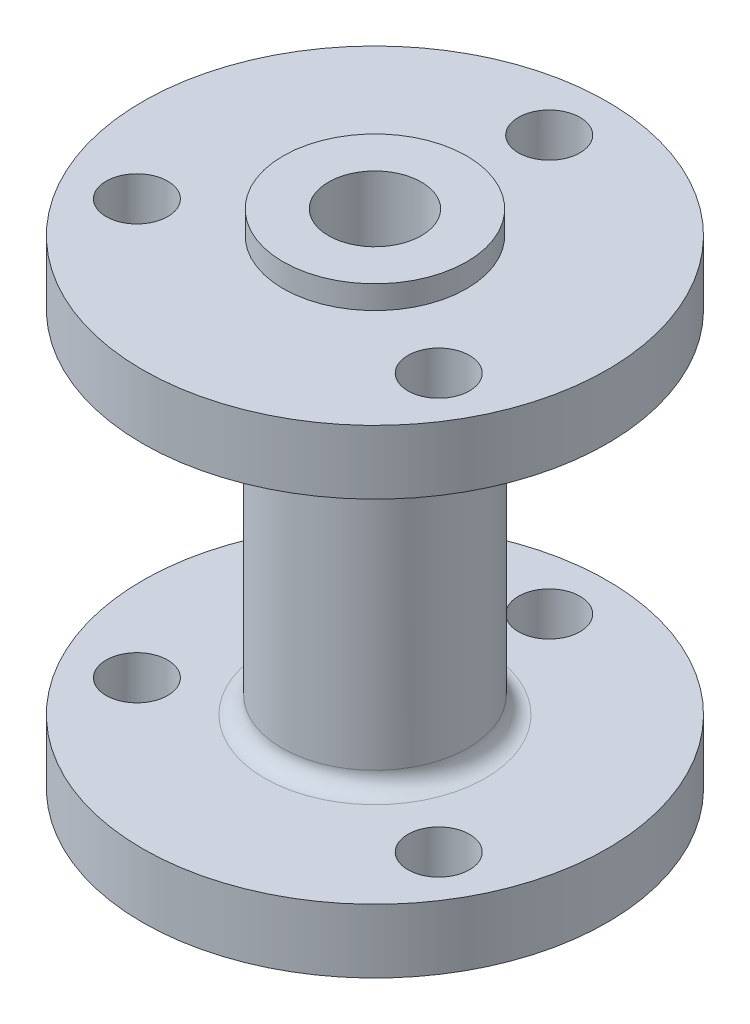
ISO-10303-21;
HEADER;
FILE_DESCRIPTION(('STEP AP214'),'2;1');
FILE_NAME('part.step','',(''),(''),'','','');
FILE_SCHEMA(('AUTOMOTIVE_DESIGN { 1 0 10303 214 1 1 1 1 }'));
ENDSEC;
DATA;
#1=APPLICATION_CONTEXT('core data for automotive mechanical design processes');
#2=APPLICATION_PROTOCOL_DEFINITION('international standard','automotive_design',2000,#1);
#3=PRODUCT_CONTEXT('',#1,'mechanical');
#4=PRODUCT('Part','Part','',(#3));
#5=PRODUCT_RELATED_PRODUCT_CATEGORY('part','',(#4));
#6=PRODUCT_DEFINITION_FORMATION('','',#4);
#7=PRODUCT_DEFINITION_CONTEXT('part definition',#1,'design');
#8=PRODUCT_DEFINITION('design','',#6,#7);
#9=PRODUCT_DEFINITION_SHAPE('','',#8);
#10=(LENGTH_UNIT() NAMED_UNIT(*) SI_UNIT(.MILLI.,.METRE.));
#11=(NAMED_UNIT(*) PLANE_ANGLE_UNIT() SI_UNIT($,.RADIAN.));
#12=(NAMED_UNIT(*) SI_UNIT($,.STERADIAN.) SOLID_ANGLE_UNIT());
#13=UNCERTAINTY_MEASURE_WITH_UNIT(LENGTH_MEASURE(1.E-05),#10,'distance_accuracy_value','');
#14=(GEOMETRIC_REPRESENTATION_CONTEXT(3) GLOBAL_UNCERTAINTY_ASSIGNED_CONTEXT((#13)) GLOBAL_UNIT_ASSIGNED_CONTEXT((#10,
#11,#12)) REPRESENTATION_CONTEXT('',''));
#15=CARTESIAN_POINT('',(0.,0.,0.));
#16=DIRECTION('',(0.,0.,1.));
#17=DIRECTION('',(1.,0.,0.));
#18=AXIS2_PLACEMENT_3D('',#15,#16,#17);
#19=CARTESIAN_POINT('',(0.,22.6,0.));
#20=DIRECTION('',(0.,1.,0.));
#21=DIRECTION('',(0.,0.,1.));
#22=AXIS2_PLACEMENT_3D('',#19,#20,#21);
#23=PLANE('',#22);
#24=CARTESIAN_POINT('',(0.,22.6,0.));
#25=DIRECTION('',(0.,1.,0.));
#26=DIRECTION('',(0.,0.,1.));
#27=AXIS2_PLACEMENT_3D('',#24,#25,#26);
#28=CIRCLE('',#27,3.99999999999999);
#29=CARTESIAN_POINT('',(0.,22.6,3.99999999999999));
#30=VERTEX_POINT('',#29);
#31=EDGE_CURVE('E110',#30,#30,#28,.T.);
#32=ORIENTED_EDGE('',*,*,#31,.F.);
#33=EDGE_LOOP('',(#32));
#34=FACE_BOUND('',#33,.T.);
#35=CARTESIAN_POINT('',(0.,22.6,0.));
#36=DIRECTION('',(0.,1.,0.));
#37=DIRECTION('',(0.,0.,1.));
#38=AXIS2_PLACEMENT_3D('',#35,#36,#37);
#39=CIRCLE('',#38,7.90000000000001);
#40=CARTESIAN_POINT('',(0.,22.6,7.90000000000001));
#41=VERTEX_POINT('',#40);
#42=EDGE_CURVE('E62',#41,#41,#39,.T.);
#43=ORIENTED_EDGE('',*,*,#42,.T.);
#44=EDGE_LOOP('',(#43));
#45=FACE_BOUND('',#44,.T.);
#46=ADVANCED_FACE('F36',(#34,#45),#23,.T.);
#47=CARTESIAN_POINT('',(0.,50.,0.));
#48=DIRECTION('',(0.,1.,0.));
#49=DIRECTION('',(0.,0.,1.));
#50=AXIS2_PLACEMENT_3D('',#47,#48,#49);
#51=CYLINDRICAL_SURFACE('',#50,7.90000000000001);
#52=CARTESIAN_POINT('',(0.,20.6,0.));
#53=DIRECTION('',(0.,1.,0.));
#54=DIRECTION('',(0.,0.,1.));
#55=AXIS2_PLACEMENT_3D('',#52,#53,#54);
#56=CIRCLE('',#55,7.90000000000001);
#57=CARTESIAN_POINT('',(0.,20.6,7.90000000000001));
#58=VERTEX_POINT('',#57);
#59=EDGE_CURVE('E78',#58,#58,#56,.T.);
#60=ORIENTED_EDGE('',*,*,#59,.T.);
#61=EDGE_LOOP('',(#60));
#62=FACE_BOUND('',#61,.T.);
#63=ORIENTED_EDGE('',*,*,#42,.F.);
#64=EDGE_LOOP('',(#63));
#65=FACE_BOUND('',#64,.T.);
#66=ADVANCED_FACE('F158',(#62,#65),#51,.T.);
#67=CARTESIAN_POINT('',(0.,20.6,7.90000000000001));
#68=DIRECTION('',(0.,1.,0.));
#69=DIRECTION('',(0.,0.,1.));
#70=AXIS2_PLACEMENT_3D('',#67,#68,#69);
#71=PLANE('',#70);
#72=CARTESIAN_POINT('',(-12.9903810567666,20.6,7.49999999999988));
#73=DIRECTION('',(0.,1.,0.));
#74=DIRECTION('',(0.,0.,1.));
#75=AXIS2_PLACEMENT_3D('',#72,#73,#74);
#76=CIRCLE('',#75,2.65);
#77=CARTESIAN_POINT('',(-12.9903810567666,20.6,10.1499999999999));
#78=VERTEX_POINT('',#77);
#79=EDGE_CURVE('E68',#78,#78,#76,.T.);
#80=ORIENTED_EDGE('',*,*,#79,.F.);
#81=EDGE_LOOP('',(#80));
#82=FACE_BOUND('',#81,.T.);
#83=CARTESIAN_POINT('',(12.9903810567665,20.6,7.50000000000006));
#84=DIRECTION('',(0.,1.,0.));
#85=DIRECTION('',(0.,0.,1.));
#86=AXIS2_PLACEMENT_3D('',#83,#84,#85);
#87=CIRCLE('',#86,2.65);
#88=CARTESIAN_POINT('',(12.9903810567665,20.6,10.1500000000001));
#89=VERTEX_POINT('',#88);
#90=EDGE_CURVE('E74',#89,#89,#87,.T.);
#91=ORIENTED_EDGE('',*,*,#90,.F.);
#92=EDGE_LOOP('',(#91));
#93=FACE_BOUND('',#92,.T.);
#94=CARTESIAN_POINT('',(0.,20.6,-15.));
#95=DIRECTION('',(0.,1.,0.));
#96=DIRECTION('',(0.,0.,1.));
#97=AXIS2_PLACEMENT_3D('',#94,#95,#96);
#98=CIRCLE('',#97,2.65);
#99=CARTESIAN_POINT('',(0.,20.6,-12.35));
#100=VERTEX_POINT('',#99);
#101=EDGE_CURVE('E126',#100,#100,#98,.T.);
#102=ORIENTED_EDGE('',*,*,#101,.F.);
#103=EDGE_LOOP('',(#102));
#104=FACE_BOUND('',#103,.T.);
#105=CARTESIAN_POINT('',(0.,20.6,0.));
#106=DIRECTION('',(0.,1.,0.));
#107=DIRECTION('',(0.,0.,1.));
#108=AXIS2_PLACEMENT_3D('',#105,#106,#107);
#109=CIRCLE('',#108,20.);
#110=CARTESIAN_POINT('',(0.,20.6,20.));
#111=VERTEX_POINT('',#110);
#112=EDGE_CURVE('E82',#111,#111,#109,.T.);
#113=ORIENTED_EDGE('',*,*,#112,.T.);
#114=EDGE_LOOP('',(#113));
#115=FACE_BOUND('',#114,.T.);
#116=ORIENTED_EDGE('',*,*,#59,.F.);
#117=EDGE_LOOP('',(#116));
#118=FACE_BOUND('',#117,.T.);
#119=ADVANCED_FACE('F154',(#82,#93,#104,#115,#118),#71,.T.);
#120=CARTESIAN_POINT('',(0.,50.,0.));
#121=DIRECTION('',(0.,1.,0.));
#122=DIRECTION('',(0.,0.,1.));
#123=AXIS2_PLACEMENT_3D('',#120,#121,#122);
#124=CYLINDRICAL_SURFACE('',#123,20.);
#125=CARTESIAN_POINT('',(0.,15.1,0.));
#126=DIRECTION('',(0.,1.,0.));
#127=DIRECTION('',(0.,0.,1.));
#128=AXIS2_PLACEMENT_3D('',#125,#126,#127);
#129=CIRCLE('',#128,20.);
#130=CARTESIAN_POINT('',(0.,15.1,20.));
#131=VERTEX_POINT('',#130);
#132=EDGE_CURVE('E86',#131,#131,#129,.T.);
#133=ORIENTED_EDGE('',*,*,#132,.T.);
#134=EDGE_LOOP('',(#133));
#135=FACE_BOUND('',#134,.T.);
#136=ORIENTED_EDGE('',*,*,#112,.F.);
#137=EDGE_LOOP('',(#136));
#138=FACE_BOUND('',#137,.T.);
#139=ADVANCED_FACE('F157',(#135,#138),#124,.T.);
#140=CARTESIAN_POINT('',(0.,15.1,20.));
#141=DIRECTION('',(0.,-1.,0.));
#142=DIRECTION('',(0.,0.,-1.));
#143=AXIS2_PLACEMENT_3D('',#140,#141,#142);
#144=PLANE('',#143);
#145=CARTESIAN_POINT('',(0.,15.1,0.));
#146=DIRECTION('',(0.,-1.,0.));
#147=DIRECTION('',(0.,0.,-1.));
#148=AXIS2_PLACEMENT_3D('',#145,#146,#147);
#149=CIRCLE('',#148,9.5);
#150=CARTESIAN_POINT('',(0.,15.1,-9.5));
#151=VERTEX_POINT('',#150);
#152=EDGE_CURVE('E10',#151,#151,#149,.F.);
#153=ORIENTED_EDGE('',*,*,#152,.T.);
#154=EDGE_LOOP('',(#153));
#155=FACE_BOUND('',#154,.T.);
#156=CARTESIAN_POINT('',(-12.9903810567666,15.1,7.49999999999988));
#157=DIRECTION('',(0.,-1.,0.));
#158=DIRECTION('',(0.,0.,-1.));
#159=AXIS2_PLACEMENT_3D('',#156,#157,#158);
#160=CIRCLE('',#159,2.64999999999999);
#161=CARTESIAN_POINT('',(-12.9903810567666,15.1,4.84999999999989));
#162=VERTEX_POINT('',#161);
#163=EDGE_CURVE('E140',#162,#162,#160,.T.);
#164=ORIENTED_EDGE('',*,*,#163,.F.);
#165=EDGE_LOOP('',(#164));
#166=FACE_BOUND('',#165,.T.);
#167=CARTESIAN_POINT('',(12.9903810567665,15.1,7.50000000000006));
#168=DIRECTION('',(0.,-1.,0.));
#169=DIRECTION('',(0.,0.,-1.));
#170=AXIS2_PLACEMENT_3D('',#167,#168,#169);
#171=CIRCLE('',#170,2.64999999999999);
#172=CARTESIAN_POINT('',(12.9903810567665,15.1,4.85000000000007));
#173=VERTEX_POINT('',#172);
#174=EDGE_CURVE('E130',#173,#173,#171,.T.);
#175=ORIENTED_EDGE('',*,*,#174,.F.);
#176=EDGE_LOOP('',(#175));
#177=FACE_BOUND('',#176,.T.);
#178=CARTESIAN_POINT('',(0.,15.1,-15.));
#179=DIRECTION('',(0.,-1.,0.));
#180=DIRECTION('',(0.,0.,-1.));
#181=AXIS2_PLACEMENT_3D('',#178,#179,#180);
#182=CIRCLE('',#181,2.64999999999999);
#183=CARTESIAN_POINT('',(0.,15.1,-17.65));
#184=VERTEX_POINT('',#183);
#185=EDGE_CURVE('E114',#184,#184,#182,.T.);
#186=ORIENTED_EDGE('',*,*,#185,.F.);
#187=EDGE_LOOP('',(#186));
#188=FACE_BOUND('',#187,.T.);
#189=ORIENTED_EDGE('',*,*,#132,.F.);
#190=EDGE_LOOP('',(#189));
#191=FACE_BOUND('',#190,.T.);
#192=ADVANCED_FACE('F197',(#155,#166,#177,#188,#191),#144,.T.);
#193=CARTESIAN_POINT('',(0.,50.,0.));
#194=DIRECTION('',(0.,1.,0.));
#195=DIRECTION('',(0.,0.,1.));
#196=AXIS2_PLACEMENT_3D('',#193,#194,#195);
#197=CYLINDRICAL_SURFACE('',#196,8.);
#198=CARTESIAN_POINT('',(0.,-13.6,0.));
#199=DIRECTION('',(0.,1.,0.));
#200=DIRECTION('',(0.,0.,1.));
#201=AXIS2_PLACEMENT_3D('',#198,#199,#200);
#202=CIRCLE('',#201,8.);
#203=CARTESIAN_POINT('',(0.,-13.6,8.));
#204=VERTEX_POINT('',#203);
#205=EDGE_CURVE('E50',#204,#204,#202,.T.);
#206=ORIENTED_EDGE('',*,*,#205,.T.);
#207=EDGE_LOOP('',(#206));
#208=FACE_BOUND('',#207,.T.);
#209=CARTESIAN_POINT('',(0.,13.6,0.));
#210=DIRECTION('',(0.,-1.,0.));
#211=DIRECTION('',(0.,0.,-1.));
#212=AXIS2_PLACEMENT_3D('',#209,#210,#211);
#213=CIRCLE('',#212,8.);
#214=CARTESIAN_POINT('',(0.,13.6,-8.));
#215=VERTEX_POINT('',#214);
#216=EDGE_CURVE('E56',#215,#215,#213,.T.);
#217=ORIENTED_EDGE('',*,*,#216,.T.);
#218=EDGE_LOOP('',(#217));
#219=FACE_BOUND('',#218,.T.);
#220=ADVANCED_FACE('F193',(#208,#219),#197,.T.);
#221=CARTESIAN_POINT('',(0.,-15.1,8.));
#222=DIRECTION('',(0.,1.,0.));
#223=DIRECTION('',(0.,0.,1.));
#224=AXIS2_PLACEMENT_3D('',#221,#222,#223);
#225=PLANE('',#224);
#226=CARTESIAN_POINT('',(0.,-15.1,0.));
#227=DIRECTION('',(0.,1.,0.));
#228=DIRECTION('',(0.,0.,1.));
#229=AXIS2_PLACEMENT_3D('',#226,#227,#228);
#230=CIRCLE('',#229,9.5);
#231=CARTESIAN_POINT('',(0.,-15.1,9.5));
#232=VERTEX_POINT('',#231);
#233=EDGE_CURVE('E44',#232,#232,#230,.F.);
#234=ORIENTED_EDGE('',*,*,#233,.T.);
#235=EDGE_LOOP('',(#234));
#236=FACE_BOUND('',#235,.T.);
#237=CARTESIAN_POINT('',(-12.9903810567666,-15.1,7.49999999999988));
#238=DIRECTION('',(0.,1.,0.));
#239=DIRECTION('',(0.,0.,1.));
#240=AXIS2_PLACEMENT_3D('',#237,#238,#239);
#241=CIRCLE('',#240,2.64999999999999);
#242=CARTESIAN_POINT('',(-12.9903810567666,-15.1,10.1499999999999));
#243=VERTEX_POINT('',#242);
#244=EDGE_CURVE('E67',#243,#243,#241,.T.);
#245=ORIENTED_EDGE('',*,*,#244,.F.);
#246=EDGE_LOOP('',(#245));
#247=FACE_BOUND('',#246,.T.);
#248=CARTESIAN_POINT('',(12.9903810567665,-15.1,7.50000000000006));
#249=DIRECTION('',(0.,1.,0.));
#250=DIRECTION('',(0.,0.,1.));
#251=AXIS2_PLACEMENT_3D('',#248,#249,#250);
#252=CIRCLE('',#251,2.64999999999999);
#253=CARTESIAN_POINT('',(12.9903810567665,-15.1,10.1500000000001));
#254=VERTEX_POINT('',#253);
#255=EDGE_CURVE('E73',#254,#254,#252,.T.);
#256=ORIENTED_EDGE('',*,*,#255,.F.);
#257=EDGE_LOOP('',(#256));
#258=FACE_BOUND('',#257,.T.);
#259=CARTESIAN_POINT('',(0.,-15.1,-15.));
#260=DIRECTION('',(0.,1.,0.));
#261=DIRECTION('',(0.,0.,1.));
#262=AXIS2_PLACEMENT_3D('',#259,#260,#261);
#263=CIRCLE('',#262,2.64999999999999);
#264=CARTESIAN_POINT('',(0.,-15.1,-12.35));
#265=VERTEX_POINT('',#264);
#266=EDGE_CURVE('E118',#265,#265,#263,.T.);
#267=ORIENTED_EDGE('',*,*,#266,.F.);
#268=EDGE_LOOP('',(#267));
#269=FACE_BOUND('',#268,.T.);
#270=CARTESIAN_POINT('',(0.,-15.1,0.));
#271=DIRECTION('',(0.,1.,0.));
#272=DIRECTION('',(0.,0.,1.));
#273=AXIS2_PLACEMENT_3D('',#270,#271,#272);
#274=CIRCLE('',#273,20.);
#275=CARTESIAN_POINT('',(0.,-15.1,20.));
#276=VERTEX_POINT('',#275);
#277=EDGE_CURVE('E90',#276,#276,#274,.T.);
#278=ORIENTED_EDGE('',*,*,#277,.T.);
#279=EDGE_LOOP('',(#278));
#280=FACE_BOUND('',#279,.T.);
#281=ADVANCED_FACE('F196',(#236,#247,#258,#269,#280),#225,.T.);
#282=CARTESIAN_POINT('',(0.,50.,0.));
#283=DIRECTION('',(0.,1.,0.));
#284=DIRECTION('',(0.,0.,1.));
#285=AXIS2_PLACEMENT_3D('',#282,#283,#284);
#286=CYLINDRICAL_SURFACE('',#285,20.);
#287=CARTESIAN_POINT('',(0.,-20.6,0.));
#288=DIRECTION('',(0.,1.,0.));
#289=DIRECTION('',(0.,0.,1.));
#290=AXIS2_PLACEMENT_3D('',#287,#288,#289);
#291=CIRCLE('',#290,20.);
#292=CARTESIAN_POINT('',(0.,-20.6,20.));
#293=VERTEX_POINT('',#292);
#294=EDGE_CURVE('E94',#293,#293,#291,.T.);
#295=ORIENTED_EDGE('',*,*,#294,.T.);
#296=EDGE_LOOP('',(#295));
#297=FACE_BOUND('',#296,.T.);
#298=ORIENTED_EDGE('',*,*,#277,.F.);
#299=EDGE_LOOP('',(#298));
#300=FACE_BOUND('',#299,.T.);
#301=ADVANCED_FACE('F205',(#297,#300),#286,.T.);
#302=CARTESIAN_POINT('',(0.,-20.6,20.));
#303=DIRECTION('',(0.,-1.,0.));
#304=DIRECTION('',(0.,0.,-1.));
#305=AXIS2_PLACEMENT_3D('',#302,#303,#304);
#306=PLANE('',#305);
#307=CARTESIAN_POINT('',(-12.9903810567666,-20.6,7.49999999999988));
#308=DIRECTION('',(0.,-1.,0.));
#309=DIRECTION('',(0.,0.,-1.));
#310=AXIS2_PLACEMENT_3D('',#307,#308,#309);
#311=CIRCLE('',#310,2.64999999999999);
#312=CARTESIAN_POINT('',(-12.9903810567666,-20.6,4.84999999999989));
#313=VERTEX_POINT('',#312);
#314=EDGE_CURVE('E63',#313,#313,#311,.T.);
#315=ORIENTED_EDGE('',*,*,#314,.F.);
#316=EDGE_LOOP('',(#315));
#317=FACE_BOUND('',#316,.T.);
#318=CARTESIAN_POINT('',(12.9903810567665,-20.6,7.50000000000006));
#319=DIRECTION('',(0.,-1.,0.));
#320=DIRECTION('',(0.,0.,-1.));
#321=AXIS2_PLACEMENT_3D('',#318,#319,#320);
#322=CIRCLE('',#321,2.64999999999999);
#323=CARTESIAN_POINT('',(12.9903810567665,-20.6,4.85000000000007));
#324=VERTEX_POINT('',#323);
#325=EDGE_CURVE('E69',#324,#324,#322,.T.);
#326=ORIENTED_EDGE('',*,*,#325,.F.);
#327=EDGE_LOOP('',(#326));
#328=FACE_BOUND('',#327,.T.);
#329=CARTESIAN_POINT('',(0.,-20.6,-15.));
#330=DIRECTION('',(0.,-1.,0.));
#331=DIRECTION('',(0.,0.,-1.));
#332=AXIS2_PLACEMENT_3D('',#329,#330,#331);
#333=CIRCLE('',#332,2.64999999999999);
#334=CARTESIAN_POINT('',(0.,-20.6,-17.65));
#335=VERTEX_POINT('',#334);
#336=EDGE_CURVE('E122',#335,#335,#333,.T.);
#337=ORIENTED_EDGE('',*,*,#336,.F.);
#338=EDGE_LOOP('',(#337));
#339=FACE_BOUND('',#338,.T.);
#340=CARTESIAN_POINT('',(0.,-20.6,0.));
#341=DIRECTION('',(0.,1.,0.));
#342=DIRECTION('',(0.,0.,1.));
#343=AXIS2_PLACEMENT_3D('',#340,#341,#342);
#344=CIRCLE('',#343,7.9);
#345=CARTESIAN_POINT('',(0.,-20.6,7.9));
#346=VERTEX_POINT('',#345);
#347=EDGE_CURVE('E98',#346,#346,#344,.T.);
#348=ORIENTED_EDGE('',*,*,#347,.T.);
#349=EDGE_LOOP('',(#348));
#350=FACE_BOUND('',#349,.T.);
#351=ORIENTED_EDGE('',*,*,#294,.F.);
#352=EDGE_LOOP('',(#351));
#353=FACE_BOUND('',#352,.T.);
#354=ADVANCED_FACE('F244',(#317,#328,#339,#350,#353),#306,.T.);
#355=CARTESIAN_POINT('',(0.,50.,0.));
#356=DIRECTION('',(0.,1.,0.));
#357=DIRECTION('',(0.,0.,1.));
#358=AXIS2_PLACEMENT_3D('',#355,#356,#357);
#359=CYLINDRICAL_SURFACE('',#358,7.9);
#360=CARTESIAN_POINT('',(0.,-22.6,0.));
#361=DIRECTION('',(0.,1.,0.));
#362=DIRECTION('',(0.,0.,1.));
#363=AXIS2_PLACEMENT_3D('',#360,#361,#362);
#364=CIRCLE('',#363,7.9);
#365=CARTESIAN_POINT('',(0.,-22.6,7.9));
#366=VERTEX_POINT('',#365);
#367=EDGE_CURVE('E102',#366,#366,#364,.T.);
#368=ORIENTED_EDGE('',*,*,#367,.T.);
#369=EDGE_LOOP('',(#368));
#370=FACE_BOUND('',#369,.T.);
#371=ORIENTED_EDGE('',*,*,#347,.F.);
#372=EDGE_LOOP('',(#371));
#373=FACE_BOUND('',#372,.T.);
#374=ADVANCED_FACE('F254',(#370,#373),#359,.T.);
#375=CARTESIAN_POINT('',(0.,-22.6,7.9));
#376=DIRECTION('',(0.,-1.,0.));
#377=DIRECTION('',(0.,0.,-1.));
#378=AXIS2_PLACEMENT_3D('',#375,#376,#377);
#379=PLANE('',#378);
#380=CARTESIAN_POINT('',(0.,-22.6,0.));
#381=DIRECTION('',(0.,-1.,0.));
#382=DIRECTION('',(0.,0.,-1.));
#383=AXIS2_PLACEMENT_3D('',#380,#381,#382);
#384=CIRCLE('',#383,3.99999999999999);
#385=CARTESIAN_POINT('',(0.,-22.6,-3.99999999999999));
#386=VERTEX_POINT('',#385);
#387=EDGE_CURVE('E106',#386,#386,#384,.T.);
#388=ORIENTED_EDGE('',*,*,#387,.F.);
#389=EDGE_LOOP('',(#388));
#390=FACE_BOUND('',#389,.T.);
#391=ORIENTED_EDGE('',*,*,#367,.F.);
#392=EDGE_LOOP('',(#391));
#393=FACE_BOUND('',#392,.T.);
#394=ADVANCED_FACE('F265',(#390,#393),#379,.T.);
#395=CARTESIAN_POINT('',(0.,22.6,0.));
#396=DIRECTION('',(0.,1.,0.));
#397=DIRECTION('',(0.,0.,1.));
#398=AXIS2_PLACEMENT_3D('',#395,#396,#397);
#399=CYLINDRICAL_SURFACE('',#398,3.99999999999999);
#400=ORIENTED_EDGE('',*,*,#31,.T.);
#401=EDGE_LOOP('',(#400));
#402=FACE_BOUND('',#401,.T.);
#403=ORIENTED_EDGE('',*,*,#387,.T.);
#404=EDGE_LOOP('',(#403));
#405=FACE_BOUND('',#404,.T.);
#406=ADVANCED_FACE('F276',(#402,#405),#399,.F.);
#407=CARTESIAN_POINT('',(0.,20.6,-15.));
#408=DIRECTION('',(0.,1.,0.));
#409=DIRECTION('',(0.,0.,1.));
#410=AXIS2_PLACEMENT_3D('',#407,#408,#409);
#411=CYLINDRICAL_SURFACE('',#410,2.64999999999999);
#412=ORIENTED_EDGE('',*,*,#185,.T.);
#413=EDGE_LOOP('',(#412));
#414=FACE_BOUND('',#413,.T.);
#415=ORIENTED_EDGE('',*,*,#101,.T.);
#416=EDGE_LOOP('',(#415));
#417=FACE_BOUND('',#416,.T.);
#418=ADVANCED_FACE('F286',(#414,#417),#411,.F.);
#419=ORIENTED_EDGE('',*,*,#266,.T.);
#420=EDGE_LOOP('',(#419));
#421=FACE_BOUND('',#420,.T.);
#422=ORIENTED_EDGE('',*,*,#336,.T.);
#423=EDGE_LOOP('',(#422));
#424=FACE_BOUND('',#423,.T.);
#425=ADVANCED_FACE('F296',(#421,#424),#411,.F.);
#426=CARTESIAN_POINT('',(12.9903810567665,20.6,7.50000000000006));
#427=DIRECTION('',(0.,1.,0.));
#428=DIRECTION('',(0.,0.,1.));
#429=AXIS2_PLACEMENT_3D('',#426,#427,#428);
#430=CYLINDRICAL_SURFACE('',#429,2.64999999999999);
#431=ORIENTED_EDGE('',*,*,#255,.T.);
#432=EDGE_LOOP('',(#431));
#433=FACE_BOUND('',#432,.T.);
#434=ORIENTED_EDGE('',*,*,#325,.T.);
#435=EDGE_LOOP('',(#434));
#436=FACE_BOUND('',#435,.T.);
#437=ADVANCED_FACE('F306',(#433,#436),#430,.F.);
#438=ORIENTED_EDGE('',*,*,#174,.T.);
#439=EDGE_LOOP('',(#438));
#440=FACE_BOUND('',#439,.T.);
#441=ORIENTED_EDGE('',*,*,#90,.T.);
#442=EDGE_LOOP('',(#441));
#443=FACE_BOUND('',#442,.T.);
#444=ADVANCED_FACE('F314',(#440,#443),#430,.F.);
#445=CARTESIAN_POINT('',(-12.9903810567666,20.6,7.49999999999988));
#446=DIRECTION('',(0.,1.,0.));
#447=DIRECTION('',(0.,0.,1.));
#448=AXIS2_PLACEMENT_3D('',#445,#446,#447);
#449=CYLINDRICAL_SURFACE('',#448,2.64999999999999);
#450=ORIENTED_EDGE('',*,*,#244,.T.);
#451=EDGE_LOOP('',(#450));
#452=FACE_BOUND('',#451,.T.);
#453=ORIENTED_EDGE('',*,*,#314,.T.);
#454=EDGE_LOOP('',(#453));
#455=FACE_BOUND('',#454,.T.);
#456=ADVANCED_FACE('F187',(#452,#455),#449,.F.);
#457=ORIENTED_EDGE('',*,*,#163,.T.);
#458=EDGE_LOOP('',(#457));
#459=FACE_BOUND('',#458,.T.);
#460=ORIENTED_EDGE('',*,*,#79,.T.);
#461=EDGE_LOOP('',(#460));
#462=FACE_BOUND('',#461,.T.);
#463=ADVANCED_FACE('F152',(#459,#462),#449,.F.);
#464=CARTESIAN_POINT('',(0.,-13.6,0.));
#465=DIRECTION('',(0.,1.,0.));
#466=DIRECTION('',(0.,0.,1.));
#467=AXIS2_PLACEMENT_3D('',#464,#465,#466);
#468=TOROIDAL_SURFACE('',#467,9.5,1.5);
#469=ORIENTED_EDGE('',*,*,#233,.F.);
#470=EDGE_LOOP('',(#469));
#471=FACE_BOUND('',#470,.T.);
#472=ORIENTED_EDGE('',*,*,#205,.F.);
#473=EDGE_LOOP('',(#472));
#474=FACE_BOUND('',#473,.T.);
#475=ADVANCED_FACE('F179',(#471,#474),#468,.F.);
#476=CARTESIAN_POINT('',(0.,13.6,0.));
#477=DIRECTION('',(0.,-1.,0.));
#478=DIRECTION('',(0.,0.,-1.));
#479=AXIS2_PLACEMENT_3D('',#476,#477,#478);
#480=TOROIDAL_SURFACE('',#479,9.5,1.5);
#481=ORIENTED_EDGE('',*,*,#216,.F.);
#482=EDGE_LOOP('',(#481));
#483=FACE_BOUND('',#482,.T.);
#484=ORIENTED_EDGE('',*,*,#152,.F.);
#485=EDGE_LOOP('',(#484));
#486=FACE_BOUND('',#485,.T.);
#487=ADVANCED_FACE('F38',(#483,#486),#480,.F.);
#488=CLOSED_SHELL('',(#46,#66,#119,#139,#192,#220,#281,#301,#354,#374,#394,#406,#418,#425,#437,
#444,#456,#463,#475,#487));
#489=MANIFOLD_SOLID_BREP('B2',#488);
#490=ADVANCED_BREP_SHAPE_REPRESENTATION('',(#18,#489),#14);
#491=SHAPE_DEFINITION_REPRESENTATION(#9,#490);
ENDSEC;
END-ISO-10303-21;
